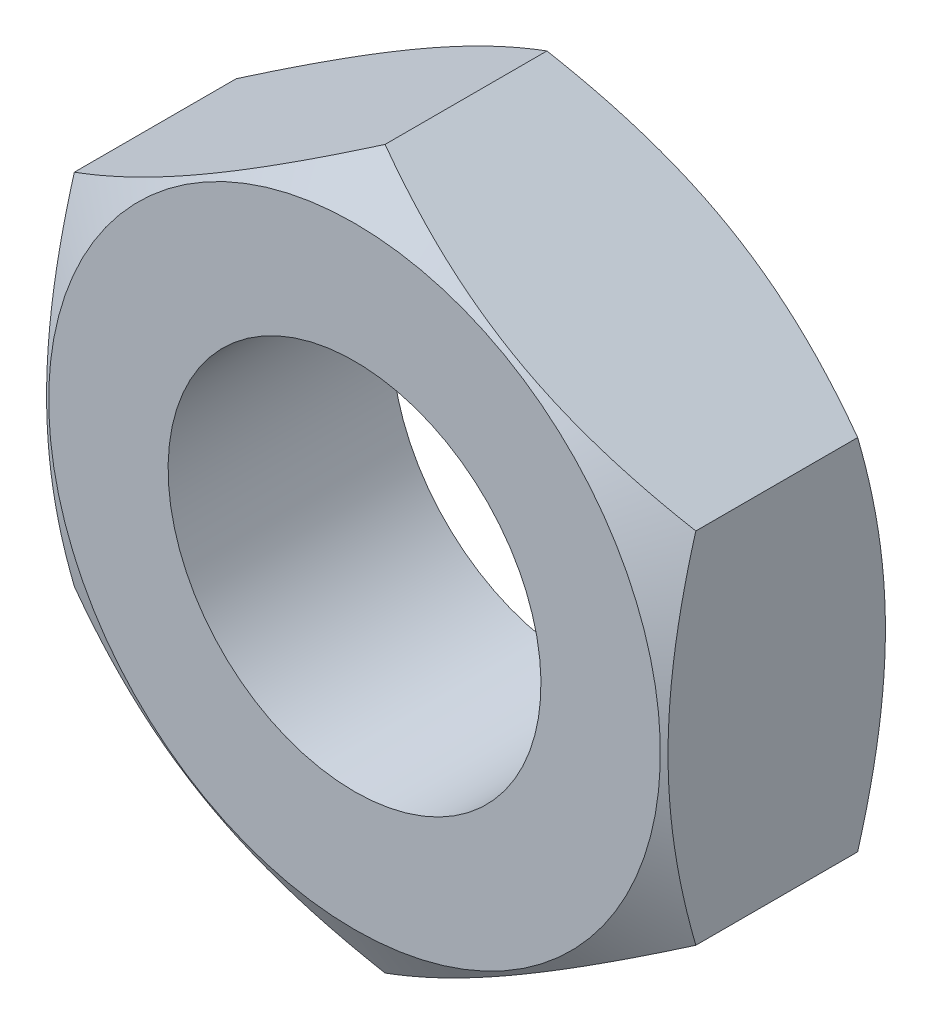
ISO-10303-21;
HEADER;
FILE_DESCRIPTION(('STEP AP214'),'2;1');
FILE_NAME('part.step','',(''),(''),'','','');
FILE_SCHEMA(('AUTOMOTIVE_DESIGN { 1 0 10303 214 1 1 1 1 }'));
ENDSEC;
DATA;
#1=APPLICATION_CONTEXT('core data for automotive mechanical design processes');
#2=APPLICATION_PROTOCOL_DEFINITION('international standard','automotive_design',2000,#1);
#3=PRODUCT_CONTEXT('',#1,'mechanical');
#4=PRODUCT('Part','Part','',(#3));
#5=PRODUCT_RELATED_PRODUCT_CATEGORY('part','',(#4));
#6=PRODUCT_DEFINITION_FORMATION('','',#4);
#7=PRODUCT_DEFINITION_CONTEXT('part definition',#1,'design');
#8=PRODUCT_DEFINITION('design','',#6,#7);
#9=PRODUCT_DEFINITION_SHAPE('','',#8);
#10=(LENGTH_UNIT() NAMED_UNIT(*) SI_UNIT(.MILLI.,.METRE.));
#11=(NAMED_UNIT(*) PLANE_ANGLE_UNIT() SI_UNIT($,.RADIAN.));
#12=(NAMED_UNIT(*) SI_UNIT($,.STERADIAN.) SOLID_ANGLE_UNIT());
#13=UNCERTAINTY_MEASURE_WITH_UNIT(LENGTH_MEASURE(1.E-05),#10,'distance_accuracy_value','');
#14=(GEOMETRIC_REPRESENTATION_CONTEXT(3) GLOBAL_UNCERTAINTY_ASSIGNED_CONTEXT((#13)) GLOBAL_UNIT_ASSIGNED_CONTEXT((#10,
#11,#12)) REPRESENTATION_CONTEXT('',''));
#15=CARTESIAN_POINT('',(0.,0.,0.));
#16=DIRECTION('',(0.,0.,1.));
#17=DIRECTION('',(1.,0.,0.));
#18=AXIS2_PLACEMENT_3D('',#15,#16,#17);
#19=CARTESIAN_POINT('',(-5.,-2.88675134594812,5.));
#20=DIRECTION('',(-1.,0.,0.));
#21=DIRECTION('',(0.,0.,1.));
#22=AXIS2_PLACEMENT_3D('',#19,#20,#21);
#23=PLANE('',#22);
#24=CARTESIAN_POINT('',(-5.,-7.76888973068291,1.10753700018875));
#25=CARTESIAN_POINT('',(-5.,-7.55038555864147,1.21359022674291));
#26=CARTESIAN_POINT('',(-5.,-7.33138137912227,1.31863083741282));
#27=CARTESIAN_POINT('',(-5.,-6.89210716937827,1.52611762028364));
#28=CARTESIAN_POINT('',(-5.,-6.67183694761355,1.62856338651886));
#29=CARTESIAN_POINT('',(-5.,-6.22863695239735,1.83080353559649));
#30=CARTESIAN_POINT('',(-5.,-6.00569923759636,1.93058057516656));
#31=CARTESIAN_POINT('',(-5.,-5.55805581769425,2.12607118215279));
#32=CARTESIAN_POINT('',(-5.,-5.33335019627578,2.22178494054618));
#33=CARTESIAN_POINT('',(-5.,-4.87449835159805,2.41109483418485));
#34=CARTESIAN_POINT('',(-5.,-4.64028204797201,2.50452203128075));
#35=CARTESIAN_POINT('',(-5.,-4.16911463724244,2.68434107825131));
#36=CARTESIAN_POINT('',(-5.,-3.93216322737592,2.77073214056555));
#37=CARTESIAN_POINT('',(-5.,-3.45558748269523,2.93422177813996));
#38=CARTESIAN_POINT('',(-5.,-3.21596962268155,3.01133903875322));
#39=CARTESIAN_POINT('',(-5.,-2.73329653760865,3.15381613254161));
#40=CARTESIAN_POINT('',(-5.,-2.490242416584,3.21917965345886));
#41=CARTESIAN_POINT('',(-5.,-2.00191441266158,3.3346725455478));
#42=CARTESIAN_POINT('',(-5.,-1.75666060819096,3.38488525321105));
#43=CARTESIAN_POINT('',(-5.,-1.26308736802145,3.46725011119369));
#44=CARTESIAN_POINT('',(-5.,-1.01476822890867,3.49940399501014));
#45=CARTESIAN_POINT('',(-5.,-0.519554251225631,3.54266588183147));
#46=CARTESIAN_POINT('',(-5.,-0.272683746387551,3.55404556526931));
#47=CARTESIAN_POINT('',(-5.,0.221141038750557,3.55551027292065));
#48=CARTESIAN_POINT('',(-5.,0.468095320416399,3.54559493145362));
#49=CARTESIAN_POINT('',(-5.,0.886914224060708,3.51142373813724));
#50=CARTESIAN_POINT('',(-5.,1.05922520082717,3.49232183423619));
#51=CARTESIAN_POINT('',(-5.,1.40258789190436,3.44493179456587));
#52=CARTESIAN_POINT('',(-5.,1.57363943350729,3.41664242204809));
#53=CARTESIAN_POINT('',(-5.,2.08467634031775,3.31947971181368));
#54=CARTESIAN_POINT('',(-5.,2.42235363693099,3.23832937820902));
#55=CARTESIAN_POINT('',(-5.,2.927286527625,3.09758707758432));
#56=CARTESIAN_POINT('',(-5.,3.09715891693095,3.04684829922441));
#57=CARTESIAN_POINT('',(-5.,3.43525357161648,2.94009442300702));
#58=CARTESIAN_POINT('',(-5.,3.60347582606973,2.88407929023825));
#59=CARTESIAN_POINT('',(-5.,3.93832333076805,2.76767214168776));
#60=CARTESIAN_POINT('',(-5.,4.1049490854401,2.70728156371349));
#61=CARTESIAN_POINT('',(-5.,4.43681968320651,2.58283463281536));
#62=CARTESIAN_POINT('',(-5.,4.60206454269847,2.51877832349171));
#63=CARTESIAN_POINT('',(-5.,4.99284806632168,2.36309983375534));
#64=CARTESIAN_POINT('',(-5.,5.21784519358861,2.27012076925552));
#65=CARTESIAN_POINT('',(-5.,5.66591568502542,2.07962413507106));
#66=CARTESIAN_POINT('',(-5.,5.8889889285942,1.98210628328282));
#67=CARTESIAN_POINT('',(-5.,6.33356725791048,1.78344739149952));
#68=CARTESIAN_POINT('',(-5.,6.555072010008,1.68230560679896));
#69=CARTESIAN_POINT('',(-5.,6.99673606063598,1.4771214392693));
#70=CARTESIAN_POINT('',(-5.,7.21689532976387,1.37307899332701));
#71=CARTESIAN_POINT('',(-5.,7.87616934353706,1.05722279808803));
#72=CARTESIAN_POINT('',(-5.,8.31360066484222,0.84189756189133));
#73=CARTESIAN_POINT('',(-5.,9.18522358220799,0.40496033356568));
#74=CARTESIAN_POINT('',(-5.,9.61941556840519,0.183349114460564));
#75=CARTESIAN_POINT('',(-5.,10.4489459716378,-0.245468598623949));
#76=CARTESIAN_POINT('',(-5.,10.8444719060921,-0.452313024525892));
#77=CARTESIAN_POINT('',(-5.,11.634051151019,-0.868823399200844));
#78=CARTESIAN_POINT('',(-5.,12.0281044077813,-1.07848944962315));
#79=CARTESIAN_POINT('',(-5.,12.8140667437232,-1.49943898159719));
#80=CARTESIAN_POINT('',(-5.,13.205978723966,-1.71071705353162));
#81=CARTESIAN_POINT('',(-5.,13.9888614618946,-2.13495852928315));
#82=CARTESIAN_POINT('',(-5.,14.3798322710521,-2.34792183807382));
#83=CARTESIAN_POINT('',(-5.,14.7704570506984,-2.56151337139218));
#84=B_SPLINE_CURVE_WITH_KNOTS('',3,(#24,#25,#26,#27,#28,#29,#30,#31,#32,#33,#34,#35,#36,#37,#38,
#39,#40,#41,#42,#43,#44,#45,#46,#47,#48,#49,#50,#51,#52,#53,#54,#55,#56,#57,#58,#59,#60,#61,#62,
#63,#64,#65,#66,#67,#68,#69,#70,#71,#72,#73,#74,#75,#76,#77,#78,#79,#80,#81,#82,#83),
.UNSPECIFIED.,.F.,.F.,(4,2,2,2,2,2,2,2,2,2,2,2,2,2,2,2,2,2,2,2,2,2,2,2,2,2,2,2,2,4),(0.,
0.728652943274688,1.45741918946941,2.19012823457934,2.92280280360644,3.67920287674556,
4.43568749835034,5.19062142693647,5.94531807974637,6.6957845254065,7.44617892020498,
8.18668752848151,8.92720885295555,9.44705650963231,9.966974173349,11.0073803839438,
11.539199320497,12.0710217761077,12.6026702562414,13.1343124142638,13.8646007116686,
14.5949344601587,15.3254191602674,16.0559197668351,17.5185003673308,18.9809018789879,
20.3199269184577,21.6590003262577,22.9946981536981,24.3303211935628),.UNSPECIFIED.);
#85=CARTESIAN_POINT('',(-5.,2.88675134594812,3.10823427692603));
#86=VERTEX_POINT('',#85);
#87=CARTESIAN_POINT('',(-5.,-2.88675134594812,3.10823427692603));
#88=VERTEX_POINT('',#87);
#89=EDGE_CURVE('E74',#86,#88,#84,.F.);
#90=ORIENTED_EDGE('',*,*,#89,.F.);
#91=DIRECTION('',(0.,0.,-1.));
#92=VECTOR('',#91,1.);
#93=CARTESIAN_POINT('',(-5.,2.88675134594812,5.));
#94=LINE('',#93,#92);
#95=CARTESIAN_POINT('',(-5.,2.88675134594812,0.504317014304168));
#96=VERTEX_POINT('',#95);
#97=EDGE_CURVE('E43',#86,#96,#94,.T.);
#98=ORIENTED_EDGE('',*,*,#97,.T.);
#99=CARTESIAN_POINT('',(-5.,-7.78275116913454,2.5117456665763));
#100=CARTESIAN_POINT('',(-5.,-7.56412896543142,2.40557968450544));
#101=CARTESIAN_POINT('',(-5.,-7.34500796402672,2.30042341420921));
#102=CARTESIAN_POINT('',(-5.,-6.90550322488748,2.09269759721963));
#103=CARTESIAN_POINT('',(-5.,-6.68511929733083,1.99012845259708));
#104=CARTESIAN_POINT('',(-5.,-6.24170172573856,1.78763426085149));
#105=CARTESIAN_POINT('',(-5.,-6.01866020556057,1.68772640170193));
#106=CARTESIAN_POINT('',(-5.,-5.57081317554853,1.49196112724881));
#107=CARTESIAN_POINT('',(-5.,-5.34600774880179,1.39610352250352));
#108=CARTESIAN_POINT('',(-5.,-4.88690528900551,1.20646272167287));
#109=CARTESIAN_POINT('',(-5.,-4.65253781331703,1.11284913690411));
#110=CARTESIAN_POINT('',(-5.,-4.18107142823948,0.932638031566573));
#111=CARTESIAN_POINT('',(-5.,-3.94397221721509,0.846041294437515));
#112=CARTESIAN_POINT('',(-5.,-3.46709984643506,0.6821162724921));
#113=CARTESIAN_POINT('',(-5.,-3.22733311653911,0.604769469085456));
#114=CARTESIAN_POINT('',(-5.,-2.74436018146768,0.461807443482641));
#115=CARTESIAN_POINT('',(-5.,-2.50115507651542,0.3961885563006));
#116=CARTESIAN_POINT('',(-5.,-2.01252592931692,0.280164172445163));
#117=CARTESIAN_POINT('',(-5.,-1.7671221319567,0.229674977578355));
#118=CARTESIAN_POINT('',(-5.,-1.27323263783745,0.146742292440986));
#119=CARTESIAN_POINT('',(-5.,-1.02474724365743,0.11429704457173));
#120=CARTESIAN_POINT('',(-5.,-0.5291932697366,0.0704641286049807));
#121=CARTESIAN_POINT('',(-5.,-0.282149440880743,0.0588035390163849));
#122=CARTESIAN_POINT('',(-5.,0.212045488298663,0.0568083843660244));
#123=CARTESIAN_POINT('',(-5.,0.459196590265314,0.0664741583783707));
#124=CARTESIAN_POINT('',(-5.,0.877939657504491,0.100231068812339));
#125=CARTESIAN_POINT('',(-5.,1.04997621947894,0.119130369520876));
#126=CARTESIAN_POINT('',(-5.,1.39280116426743,0.166101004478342));
#127=CARTESIAN_POINT('',(-5.,1.56358937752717,0.194173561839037));
#128=CARTESIAN_POINT('',(-5.,2.0738480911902,0.290676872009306));
#129=CARTESIAN_POINT('',(-5.,2.41102478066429,0.371376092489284));
#130=CARTESIAN_POINT('',(-5.,2.91523126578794,0.511452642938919));
#131=CARTESIAN_POINT('',(-5.,3.08487099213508,0.561971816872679));
#132=CARTESIAN_POINT('',(-5.,3.4225028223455,0.668292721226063));
#133=CARTESIAN_POINT('',(-5.,3.59049491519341,0.724094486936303));
#134=CARTESIAN_POINT('',(-5.,3.92488399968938,0.840082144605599));
#135=CARTESIAN_POINT('',(-5.,4.09128148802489,0.900266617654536));
#136=CARTESIAN_POINT('',(-5.,4.42269544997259,1.0243081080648));
#137=CARTESIAN_POINT('',(-5.,4.5877119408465,1.08816507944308));
#138=CARTESIAN_POINT('',(-5.,4.98133671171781,1.24472338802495));
#139=CARTESIAN_POINT('',(-5.,5.20936850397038,1.33887160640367));
#140=CARTESIAN_POINT('',(-5.,5.66345412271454,1.53183680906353));
#141=CARTESIAN_POINT('',(-5.,5.88950781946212,1.63065409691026));
#142=CARTESIAN_POINT('',(-5.,6.3400079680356,1.83200505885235));
#143=CARTESIAN_POINT('',(-5.,6.5644540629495,1.9345395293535));
#144=CARTESIAN_POINT('',(-5.,7.01196935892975,2.14257503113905));
#145=CARTESIAN_POINT('',(-5.,7.2350385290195,2.24807612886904));
#146=CARTESIAN_POINT('',(-5.,7.9030280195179,2.56838851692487));
#147=CARTESIAN_POINT('',(-5.,8.34622952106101,2.78678181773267));
#148=CARTESIAN_POINT('',(-5.,9.22933631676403,3.22995198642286));
#149=CARTESIAN_POINT('',(-5.,9.66924202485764,3.45472803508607));
#150=CARTESIAN_POINT('',(-5.,10.5090819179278,3.8893476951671));
#151=CARTESIAN_POINT('',(-5.,10.9092091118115,4.09881904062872));
#152=CARTESIAN_POINT('',(-5.,11.7079794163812,4.52060394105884));
#153=CARTESIAN_POINT('',(-5.,12.106622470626,4.73291760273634));
#154=CARTESIAN_POINT('',(-5.,12.9017202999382,5.15915381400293));
#155=CARTESIAN_POINT('',(-5.,13.2981780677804,5.37307078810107));
#156=CARTESIAN_POINT('',(-5.,14.0901470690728,5.80259644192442));
#157=CARTESIAN_POINT('',(-5.,14.4856583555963,6.01820502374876));
#158=CARTESIAN_POINT('',(-5.,14.8808227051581,6.2344429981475));
#159=B_SPLINE_CURVE_WITH_KNOTS('',3,(#99,#100,#101,#102,#103,#104,#105,#106,#107,#108,#109,#110,
#111,#112,#113,#114,#115,#116,#117,#118,#119,#120,#121,#122,#123,#124,#125,#126,#127,#128,#129,
#130,#131,#132,#133,#134,#135,#136,#137,#138,#139,#140,#141,#142,#143,#144,#145,#146,#147,#148,
#149,#150,#151,#152,#153,#154,#155,#156,#157,#158),.UNSPECIFIED.,.F.,.F.,(4,2,2,2,2,2,2,2,2,2,2,
2,2,2,2,2,2,2,2,2,2,2,2,2,2,2,2,2,2,4),(0.,0.7291191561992,1.45835093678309,2.19150480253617,
2.92462433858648,3.6816534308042,4.43876693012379,5.19433835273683,5.94967324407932,
6.70074898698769,7.45175155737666,8.19281804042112,8.9338963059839,9.45285971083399,
9.971892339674,11.0105210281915,11.5414824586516,12.0724474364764,12.6032412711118,
13.1340284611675,13.8740667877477,14.6141532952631,15.3543993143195,16.0946619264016,
17.5768363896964,19.0588214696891,20.4137307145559,21.7686909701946,23.1201497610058,
24.4715309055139),.UNSPECIFIED.);
#160=CARTESIAN_POINT('',(-5.,-2.88675134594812,0.504317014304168));
#161=VERTEX_POINT('',#160);
#162=EDGE_CURVE('E92',#161,#96,#159,.T.);
#163=ORIENTED_EDGE('',*,*,#162,.F.);
#164=DIRECTION('',(0.,0.,-1.));
#165=VECTOR('',#164,1.);
#166=CARTESIAN_POINT('',(-5.,-2.88675134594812,5.));
#167=LINE('',#166,#165);
#168=EDGE_CURVE('E29',#88,#161,#167,.T.);
#169=ORIENTED_EDGE('',*,*,#168,.F.);
#170=EDGE_LOOP('',(#90,#98,#163,#169));
#171=FACE_BOUND('',#170,.T.);
#172=ADVANCED_FACE('F14',(#171),#23,.T.);
#173=CARTESIAN_POINT('',(-5.,-2.88675134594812,5.));
#174=DIRECTION('',(0.5,0.86602540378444,0.));
#175=DIRECTION('',(-0.86602540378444,0.5,0.));
#176=AXIS2_PLACEMENT_3D('',#173,#174,#175);
#177=PLANE('',#176);
#178=DIRECTION('',(0.,0.,-1.));
#179=VECTOR('',#178,1.);
#180=CARTESIAN_POINT('',(0.,-5.77350269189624,5.));
#181=LINE('',#180,#179);
#182=CARTESIAN_POINT('',(0.,-5.77350269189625,3.10823427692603));
#183=VERTEX_POINT('',#182);
#184=CARTESIAN_POINT('',(0.,-5.77350269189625,0.504317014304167));
#185=VERTEX_POINT('',#184);
#186=EDGE_CURVE('E99',#183,#185,#181,.T.);
#187=ORIENTED_EDGE('',*,*,#186,.F.);
#188=CARTESIAN_POINT('',(0.000199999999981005,-5.77361816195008,3.10816760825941));
#189=CARTESIAN_POINT('',(-0.219534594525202,-5.64675433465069,3.1814296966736));
#190=CARTESIAN_POINT('',(-0.441148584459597,-5.51880543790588,3.24806494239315));
#191=CARTESIAN_POINT('',(-0.888213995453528,-5.26069210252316,3.36437727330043));
#192=CARTESIAN_POINT('',(-1.11367335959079,-5.13052307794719,3.41401321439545));
#193=CARTESIAN_POINT('',(-1.56183230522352,-4.8717783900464,3.49126523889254));
#194=CARTESIAN_POINT('',(-1.78446209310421,-4.74324302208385,3.51939588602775));
#195=CARTESIAN_POINT('',(-2.11918990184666,-4.54998783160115,3.54462134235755));
#196=CARTESIAN_POINT('',(-2.23084219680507,-4.48552534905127,3.55020280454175));
#197=CARTESIAN_POINT('',(-2.45424997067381,-4.3565408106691,3.55561404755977));
#198=CARTESIAN_POINT('',(-2.56600544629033,-4.29201875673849,3.55544400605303));
#199=CARTESIAN_POINT('',(-2.87218423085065,-4.11524635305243,3.5470626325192));
#200=CARTESIAN_POINT('',(-3.06650608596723,-4.00305457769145,3.53298649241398));
#201=CARTESIAN_POINT('',(-3.45386010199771,-3.77941563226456,3.4883510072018));
#202=CARTESIAN_POINT('',(-3.64689090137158,-3.66796924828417,3.45777640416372));
#203=CARTESIAN_POINT('',(-4.03502534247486,-3.44387972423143,3.38134777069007));
#204=CARTESIAN_POINT('',(-4.23007999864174,-3.33126486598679,3.33516988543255));
#205=CARTESIAN_POINT('',(-4.61728034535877,-3.1077146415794,3.2303644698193));
#206=CARTESIAN_POINT('',(-4.80943099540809,-2.99677641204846,3.17176156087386));
#207=CARTESIAN_POINT('',(-5.0002,-2.88663587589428,3.1081676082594));
#208=B_SPLINE_CURVE_WITH_KNOTS('',3,(#188,#189,#190,#191,#192,#193,#194,#195,#196,#197,#198,
#199,#200,#201,#202,#203,#204,#205,#206,#207),.UNSPECIFIED.,.F.,.F.,(4,2,2,2,2,2,2,2,2,4),(0.,
0.792555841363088,1.58701660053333,2.3618153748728,2.74884076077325,3.13585419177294,
3.80962362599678,4.48401723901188,5.17336882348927,5.86136694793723),.UNSPECIFIED.);
#209=EDGE_CURVE('E80',#183,#88,#208,.T.);
#210=ORIENTED_EDGE('',*,*,#209,.T.);
#211=ORIENTED_EDGE('',*,*,#168,.T.);
#212=CARTESIAN_POINT('',(-5.0002,-2.88663587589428,0.504383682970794));
#213=CARTESIAN_POINT('',(-4.78046540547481,-3.01349970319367,0.431121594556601));
#214=CARTESIAN_POINT('',(-4.55885141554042,-3.14144859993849,0.364486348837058));
#215=CARTESIAN_POINT('',(-4.11178600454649,-3.3995619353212,0.248174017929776));
#216=CARTESIAN_POINT('',(-3.88632664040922,-3.52973095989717,0.198538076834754));
#217=CARTESIAN_POINT('',(-3.43816769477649,-3.78847564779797,0.121286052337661));
#218=CARTESIAN_POINT('',(-3.2155379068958,-3.91701101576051,0.0931554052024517));
#219=CARTESIAN_POINT('',(-2.88081009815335,-4.11026620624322,0.0679299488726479));
#220=CARTESIAN_POINT('',(-2.76915780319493,-4.1747286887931,0.0623484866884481));
#221=CARTESIAN_POINT('',(-2.5457500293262,-4.30371322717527,0.0569372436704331));
#222=CARTESIAN_POINT('',(-2.43399455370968,-4.36823528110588,0.0571072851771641));
#223=CARTESIAN_POINT('',(-2.12781576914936,-4.54500768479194,0.0654886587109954));
#224=CARTESIAN_POINT('',(-1.93349391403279,-4.65719946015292,0.0795647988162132));
#225=CARTESIAN_POINT('',(-1.5461398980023,-4.8808384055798,0.124200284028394));
#226=CARTESIAN_POINT('',(-1.35310909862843,-4.99228478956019,0.154774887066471));
#227=CARTESIAN_POINT('',(-0.964974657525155,-5.21637431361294,0.231203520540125));
#228=CARTESIAN_POINT('',(-0.769920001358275,-5.32898917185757,0.277381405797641));
#229=CARTESIAN_POINT('',(-0.382719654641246,-5.55253939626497,0.382186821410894));
#230=CARTESIAN_POINT('',(-0.19056900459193,-5.6634776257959,0.440789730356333));
#231=CARTESIAN_POINT('',(0.000199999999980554,-5.77361816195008,0.504383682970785));
#232=B_SPLINE_CURVE_WITH_KNOTS('',3,(#212,#213,#214,#215,#216,#217,#218,#219,#220,#221,#222,
#223,#224,#225,#226,#227,#228,#229,#230,#231),.UNSPECIFIED.,.F.,.F.,(4,2,2,2,2,2,2,2,2,4),(0.,
0.792555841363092,1.58701660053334,2.36181537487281,2.74884076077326,3.13585419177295,
3.80962362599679,4.48401723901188,5.17336882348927,5.86136694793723),.UNSPECIFIED.);
#233=EDGE_CURVE('E164',#161,#185,#232,.T.);
#234=ORIENTED_EDGE('',*,*,#233,.T.);
#235=EDGE_LOOP('',(#187,#210,#211,#234));
#236=FACE_BOUND('',#235,.T.);
#237=ADVANCED_FACE('F16',(#236),#177,.F.);
#238=CARTESIAN_POINT('',(5.,-2.88675134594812,5.));
#239=DIRECTION('',(0.5,-0.86602540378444,0.));
#240=DIRECTION('',(0.86602540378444,0.5,0.));
#241=AXIS2_PLACEMENT_3D('',#238,#239,#240);
#242=PLANE('',#241);
#243=CARTESIAN_POINT('',(-0.000200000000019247,-5.7736181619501,3.1081676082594));
#244=CARTESIAN_POINT('',(0.219534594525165,-5.64675433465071,3.18142969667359));
#245=CARTESIAN_POINT('',(0.441148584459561,-5.5188054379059,3.24806494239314));
#246=CARTESIAN_POINT('',(0.888213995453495,-5.26069210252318,3.36437727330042));
#247=CARTESIAN_POINT('',(1.11367335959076,-5.13052307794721,3.41401321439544));
#248=CARTESIAN_POINT('',(1.56183230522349,-4.87177839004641,3.49126523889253));
#249=CARTESIAN_POINT('',(1.78446209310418,-4.74324302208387,3.51939588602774));
#250=CARTESIAN_POINT('',(2.11918990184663,-4.54998783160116,3.54462134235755));
#251=CARTESIAN_POINT('',(2.23084219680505,-4.48552534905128,3.55020280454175));
#252=CARTESIAN_POINT('',(2.45424997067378,-4.35654081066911,3.55561404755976));
#253=CARTESIAN_POINT('',(2.5660054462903,-4.2920187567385,3.55544400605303));
#254=CARTESIAN_POINT('',(2.87218423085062,-4.11524635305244,3.5470626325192));
#255=CARTESIAN_POINT('',(3.0665060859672,-4.00305457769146,3.53298649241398));
#256=CARTESIAN_POINT('',(3.4538601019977,-3.77941563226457,3.4883510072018));
#257=CARTESIAN_POINT('',(3.64689090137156,-3.66796924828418,3.45777640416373));
#258=CARTESIAN_POINT('',(4.03502534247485,-3.44387972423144,3.38134777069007));
#259=CARTESIAN_POINT('',(4.23007999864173,-3.3312648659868,3.33516988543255));
#260=CARTESIAN_POINT('',(4.61728034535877,-3.1077146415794,3.2303644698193));
#261=CARTESIAN_POINT('',(4.80943099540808,-2.99677641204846,3.17176156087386));
#262=CARTESIAN_POINT('',(5.0002,-2.88663587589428,3.1081676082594));
#263=B_SPLINE_CURVE_WITH_KNOTS('',3,(#243,#244,#245,#246,#247,#248,#249,#250,#251,#252,#253,
#254,#255,#256,#257,#258,#259,#260,#261,#262),.UNSPECIFIED.,.F.,.F.,(4,2,2,2,2,2,2,2,2,4),(0.,
0.792555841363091,1.58701660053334,2.36181537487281,2.74884076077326,3.13585419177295,
3.8096236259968,4.48401723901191,5.1733688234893,5.86136694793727),.UNSPECIFIED.);
#264=CARTESIAN_POINT('',(5.,-2.88675134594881,3.10823427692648));
#265=VERTEX_POINT('',#264);
#266=EDGE_CURVE('E135',#183,#265,#263,.T.);
#267=ORIENTED_EDGE('',*,*,#266,.F.);
#268=ORIENTED_EDGE('',*,*,#186,.T.);
#269=CARTESIAN_POINT('',(5.0002,-2.88663587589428,0.504383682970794));
#270=CARTESIAN_POINT('',(4.78046540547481,-3.01349970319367,0.431121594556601));
#271=CARTESIAN_POINT('',(4.55885141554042,-3.14144859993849,0.364486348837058));
#272=CARTESIAN_POINT('',(4.11178600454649,-3.3995619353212,0.248174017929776));
#273=CARTESIAN_POINT('',(3.88632664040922,-3.52973095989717,0.198538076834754));
#274=CARTESIAN_POINT('',(3.43816769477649,-3.78847564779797,0.121286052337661));
#275=CARTESIAN_POINT('',(3.2155379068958,-3.91701101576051,0.0931554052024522));
#276=CARTESIAN_POINT('',(2.88081009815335,-4.11026620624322,0.067929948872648));
#277=CARTESIAN_POINT('',(2.76915780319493,-4.1747286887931,0.062348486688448));
#278=CARTESIAN_POINT('',(2.5457500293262,-4.30371322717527,0.0569372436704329));
#279=CARTESIAN_POINT('',(2.43399455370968,-4.36823528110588,0.057107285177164));
#280=CARTESIAN_POINT('',(2.12781576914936,-4.54500768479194,0.0654886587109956));
#281=CARTESIAN_POINT('',(1.93349391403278,-4.65719946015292,0.079564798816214));
#282=CARTESIAN_POINT('',(1.54613989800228,-4.88083840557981,0.124200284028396));
#283=CARTESIAN_POINT('',(1.35310909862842,-4.9922847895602,0.154774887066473));
#284=CARTESIAN_POINT('',(0.964974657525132,-5.21637431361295,0.23120352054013));
#285=CARTESIAN_POINT('',(0.76992000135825,-5.32898917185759,0.277381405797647));
#286=CARTESIAN_POINT('',(0.382719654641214,-5.55253939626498,0.382186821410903));
#287=CARTESIAN_POINT('',(0.190569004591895,-5.66347762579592,0.440789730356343));
#288=CARTESIAN_POINT('',(-0.000200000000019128,-5.7736181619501,0.504383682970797));
#289=B_SPLINE_CURVE_WITH_KNOTS('',3,(#269,#270,#271,#272,#273,#274,#275,#276,#277,#278,#279,
#280,#281,#282,#283,#284,#285,#286,#287,#288),.UNSPECIFIED.,.F.,.F.,(4,2,2,2,2,2,2,2,2,4),(0.,
0.792555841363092,1.58701660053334,2.36181537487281,2.74884076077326,3.13585419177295,
3.8096236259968,4.48401723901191,5.17336882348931,5.86136694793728),.UNSPECIFIED.);
#290=CARTESIAN_POINT('',(5.,-2.88675134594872,0.50431701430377));
#291=VERTEX_POINT('',#290);
#292=EDGE_CURVE('E196',#291,#185,#289,.T.);
#293=ORIENTED_EDGE('',*,*,#292,.F.);
#294=DIRECTION('',(0.,0.,-1.));
#295=VECTOR('',#294,1.);
#296=CARTESIAN_POINT('',(5.,-2.88675134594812,5.));
#297=LINE('',#296,#295);
#298=EDGE_CURVE('E97',#265,#291,#297,.T.);
#299=ORIENTED_EDGE('',*,*,#298,.F.);
#300=EDGE_LOOP('',(#267,#268,#293,#299));
#301=FACE_BOUND('',#300,.T.);
#302=ADVANCED_FACE('F202',(#301),#242,.T.);
#303=CARTESIAN_POINT('',(5.,-2.88675134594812,5.));
#304=DIRECTION('',(-1.,0.,0.));
#305=DIRECTION('',(0.,0.,1.));
#306=AXIS2_PLACEMENT_3D('',#303,#304,#305);
#307=PLANE('',#306);
#308=DIRECTION('',(0.,0.,-1.));
#309=VECTOR('',#308,1.);
#310=CARTESIAN_POINT('',(5.,2.88675134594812,5.));
#311=LINE('',#310,#309);
#312=CARTESIAN_POINT('',(5.,2.88675134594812,3.10823427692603));
#313=VERTEX_POINT('',#312);
#314=CARTESIAN_POINT('',(5.,2.88675134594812,0.504317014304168));
#315=VERTEX_POINT('',#314);
#316=EDGE_CURVE('E89',#313,#315,#311,.T.);
#317=ORIENTED_EDGE('',*,*,#316,.F.);
#318=CARTESIAN_POINT('',(5.,-7.76888973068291,1.10753700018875));
#319=CARTESIAN_POINT('',(5.,-7.55038555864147,1.21359022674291));
#320=CARTESIAN_POINT('',(5.,-7.33138137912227,1.31863083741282));
#321=CARTESIAN_POINT('',(5.,-6.89210716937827,1.52611762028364));
#322=CARTESIAN_POINT('',(5.,-6.67183694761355,1.62856338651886));
#323=CARTESIAN_POINT('',(5.,-6.22863695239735,1.83080353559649));
#324=CARTESIAN_POINT('',(5.,-6.00569923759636,1.93058057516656));
#325=CARTESIAN_POINT('',(5.,-5.55805581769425,2.12607118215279));
#326=CARTESIAN_POINT('',(5.,-5.33335019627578,2.22178494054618));
#327=CARTESIAN_POINT('',(5.,-4.87449835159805,2.41109483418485));
#328=CARTESIAN_POINT('',(5.,-4.64028204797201,2.50452203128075));
#329=CARTESIAN_POINT('',(5.,-4.16911463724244,2.68434107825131));
#330=CARTESIAN_POINT('',(5.,-3.93216322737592,2.77073214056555));
#331=CARTESIAN_POINT('',(5.,-3.45558748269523,2.93422177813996));
#332=CARTESIAN_POINT('',(5.,-3.21596962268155,3.01133903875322));
#333=CARTESIAN_POINT('',(5.,-2.73329653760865,3.15381613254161));
#334=CARTESIAN_POINT('',(5.,-2.490242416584,3.21917965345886));
#335=CARTESIAN_POINT('',(5.,-2.00191441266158,3.3346725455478));
#336=CARTESIAN_POINT('',(5.,-1.75666060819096,3.38488525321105));
#337=CARTESIAN_POINT('',(5.,-1.26308736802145,3.46725011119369));
#338=CARTESIAN_POINT('',(5.,-1.01476822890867,3.49940399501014));
#339=CARTESIAN_POINT('',(5.,-0.519554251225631,3.54266588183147));
#340=CARTESIAN_POINT('',(5.,-0.272683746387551,3.55404556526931));
#341=CARTESIAN_POINT('',(5.,0.221141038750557,3.55551027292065));
#342=CARTESIAN_POINT('',(5.,0.468095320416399,3.54559493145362));
#343=CARTESIAN_POINT('',(5.,0.886914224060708,3.51142373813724));
#344=CARTESIAN_POINT('',(5.,1.05922520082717,3.49232183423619));
#345=CARTESIAN_POINT('',(5.,1.40258789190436,3.44493179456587));
#346=CARTESIAN_POINT('',(5.,1.57363943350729,3.41664242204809));
#347=CARTESIAN_POINT('',(5.,2.08467634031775,3.31947971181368));
#348=CARTESIAN_POINT('',(5.,2.42235363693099,3.23832937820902));
#349=CARTESIAN_POINT('',(5.,2.927286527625,3.09758707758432));
#350=CARTESIAN_POINT('',(5.,3.09715891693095,3.04684829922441));
#351=CARTESIAN_POINT('',(5.,3.43525357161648,2.94009442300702));
#352=CARTESIAN_POINT('',(5.,3.60347582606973,2.88407929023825));
#353=CARTESIAN_POINT('',(5.,3.93832333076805,2.76767214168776));
#354=CARTESIAN_POINT('',(5.,4.1049490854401,2.70728156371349));
#355=CARTESIAN_POINT('',(5.,4.43681968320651,2.58283463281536));
#356=CARTESIAN_POINT('',(5.,4.60206454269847,2.51877832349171));
#357=CARTESIAN_POINT('',(5.,4.99284806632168,2.36309983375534));
#358=CARTESIAN_POINT('',(5.,5.21784519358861,2.27012076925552));
#359=CARTESIAN_POINT('',(5.,5.66591568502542,2.07962413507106));
#360=CARTESIAN_POINT('',(5.,5.8889889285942,1.98210628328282));
#361=CARTESIAN_POINT('',(5.,6.33356725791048,1.78344739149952));
#362=CARTESIAN_POINT('',(5.,6.555072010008,1.68230560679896));
#363=CARTESIAN_POINT('',(5.,6.99673606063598,1.4771214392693));
#364=CARTESIAN_POINT('',(5.,7.21689532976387,1.37307899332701));
#365=CARTESIAN_POINT('',(5.,7.87616934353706,1.05722279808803));
#366=CARTESIAN_POINT('',(5.,8.31360066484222,0.84189756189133));
#367=CARTESIAN_POINT('',(5.,9.18522358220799,0.40496033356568));
#368=CARTESIAN_POINT('',(5.,9.61941556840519,0.183349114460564));
#369=CARTESIAN_POINT('',(5.,10.4489459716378,-0.245468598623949));
#370=CARTESIAN_POINT('',(5.,10.8444719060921,-0.452313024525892));
#371=CARTESIAN_POINT('',(5.,11.634051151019,-0.868823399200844));
#372=CARTESIAN_POINT('',(5.,12.0281044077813,-1.07848944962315));
#373=CARTESIAN_POINT('',(5.,12.8140667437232,-1.49943898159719));
#374=CARTESIAN_POINT('',(5.,13.205978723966,-1.71071705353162));
#375=CARTESIAN_POINT('',(5.,13.9888614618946,-2.13495852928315));
#376=CARTESIAN_POINT('',(5.,14.3798322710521,-2.34792183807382));
#377=CARTESIAN_POINT('',(5.,14.7704570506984,-2.56151337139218));
#378=B_SPLINE_CURVE_WITH_KNOTS('',3,(#318,#319,#320,#321,#322,#323,#324,#325,#326,#327,#328,
#329,#330,#331,#332,#333,#334,#335,#336,#337,#338,#339,#340,#341,#342,#343,#344,#345,#346,#347,
#348,#349,#350,#351,#352,#353,#354,#355,#356,#357,#358,#359,#360,#361,#362,#363,#364,#365,#366,
#367,#368,#369,#370,#371,#372,#373,#374,#375,#376,#377),.UNSPECIFIED.,.F.,.F.,(4,2,2,2,2,2,2,2,
2,2,2,2,2,2,2,2,2,2,2,2,2,2,2,2,2,2,2,2,2,4),(0.,0.728652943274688,1.45741918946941,
2.19012823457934,2.92280280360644,3.67920287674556,4.43568749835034,5.19062142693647,
5.94531807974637,6.6957845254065,7.44617892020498,8.18668752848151,8.92720885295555,
9.44705650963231,9.966974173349,11.0073803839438,11.539199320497,12.0710217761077,
12.6026702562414,13.1343124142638,13.8646007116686,14.5949344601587,15.3254191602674,
16.0559197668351,17.5185003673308,18.9809018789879,20.3199269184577,21.6590003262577,
22.9946981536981,24.3303211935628),.UNSPECIFIED.);
#379=EDGE_CURVE('E106',#313,#265,#378,.F.);
#380=ORIENTED_EDGE('',*,*,#379,.T.);
#381=ORIENTED_EDGE('',*,*,#298,.T.);
#382=CARTESIAN_POINT('',(5.,-7.78275116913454,2.5117456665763));
#383=CARTESIAN_POINT('',(5.,-7.56412896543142,2.40557968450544));
#384=CARTESIAN_POINT('',(5.,-7.34500796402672,2.30042341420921));
#385=CARTESIAN_POINT('',(5.,-6.90550322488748,2.09269759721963));
#386=CARTESIAN_POINT('',(5.,-6.68511929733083,1.99012845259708));
#387=CARTESIAN_POINT('',(5.,-6.24170172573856,1.78763426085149));
#388=CARTESIAN_POINT('',(5.,-6.01866020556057,1.68772640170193));
#389=CARTESIAN_POINT('',(5.,-5.57081317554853,1.49196112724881));
#390=CARTESIAN_POINT('',(5.,-5.34600774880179,1.39610352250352));
#391=CARTESIAN_POINT('',(5.,-4.88690528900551,1.20646272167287));
#392=CARTESIAN_POINT('',(5.,-4.65253781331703,1.11284913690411));
#393=CARTESIAN_POINT('',(5.,-4.18107142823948,0.932638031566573));
#394=CARTESIAN_POINT('',(5.,-3.94397221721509,0.846041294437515));
#395=CARTESIAN_POINT('',(5.,-3.46709984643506,0.6821162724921));
#396=CARTESIAN_POINT('',(5.,-3.22733311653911,0.604769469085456));
#397=CARTESIAN_POINT('',(5.,-2.74436018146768,0.461807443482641));
#398=CARTESIAN_POINT('',(5.,-2.50115507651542,0.3961885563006));
#399=CARTESIAN_POINT('',(5.,-2.01252592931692,0.280164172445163));
#400=CARTESIAN_POINT('',(5.,-1.7671221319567,0.229674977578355));
#401=CARTESIAN_POINT('',(5.,-1.27323263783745,0.146742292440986));
#402=CARTESIAN_POINT('',(5.,-1.02474724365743,0.11429704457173));
#403=CARTESIAN_POINT('',(5.,-0.5291932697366,0.0704641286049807));
#404=CARTESIAN_POINT('',(5.,-0.282149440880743,0.0588035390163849));
#405=CARTESIAN_POINT('',(5.,0.212045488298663,0.0568083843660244));
#406=CARTESIAN_POINT('',(5.,0.459196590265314,0.0664741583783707));
#407=CARTESIAN_POINT('',(5.,0.877939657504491,0.100231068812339));
#408=CARTESIAN_POINT('',(5.,1.04997621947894,0.119130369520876));
#409=CARTESIAN_POINT('',(5.,1.39280116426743,0.166101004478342));
#410=CARTESIAN_POINT('',(5.,1.56358937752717,0.194173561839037));
#411=CARTESIAN_POINT('',(5.,2.0738480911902,0.290676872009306));
#412=CARTESIAN_POINT('',(5.,2.41102478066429,0.371376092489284));
#413=CARTESIAN_POINT('',(5.,2.91523126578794,0.511452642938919));
#414=CARTESIAN_POINT('',(5.,3.08487099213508,0.561971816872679));
#415=CARTESIAN_POINT('',(5.,3.4225028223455,0.668292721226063));
#416=CARTESIAN_POINT('',(5.,3.59049491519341,0.724094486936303));
#417=CARTESIAN_POINT('',(5.,3.92488399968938,0.840082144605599));
#418=CARTESIAN_POINT('',(5.,4.09128148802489,0.900266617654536));
#419=CARTESIAN_POINT('',(5.,4.42269544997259,1.0243081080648));
#420=CARTESIAN_POINT('',(5.,4.5877119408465,1.08816507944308));
#421=CARTESIAN_POINT('',(5.,4.98133671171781,1.24472338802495));
#422=CARTESIAN_POINT('',(5.,5.20936850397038,1.33887160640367));
#423=CARTESIAN_POINT('',(5.,5.66345412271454,1.53183680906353));
#424=CARTESIAN_POINT('',(5.,5.88950781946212,1.63065409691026));
#425=CARTESIAN_POINT('',(5.,6.3400079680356,1.83200505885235));
#426=CARTESIAN_POINT('',(5.,6.5644540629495,1.9345395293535));
#427=CARTESIAN_POINT('',(5.,7.01196935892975,2.14257503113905));
#428=CARTESIAN_POINT('',(5.,7.2350385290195,2.24807612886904));
#429=CARTESIAN_POINT('',(5.,7.9030280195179,2.56838851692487));
#430=CARTESIAN_POINT('',(5.,8.34622952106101,2.78678181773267));
#431=CARTESIAN_POINT('',(5.,9.22933631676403,3.22995198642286));
#432=CARTESIAN_POINT('',(5.,9.66924202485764,3.45472803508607));
#433=CARTESIAN_POINT('',(5.,10.5090819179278,3.8893476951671));
#434=CARTESIAN_POINT('',(5.,10.9092091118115,4.09881904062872));
#435=CARTESIAN_POINT('',(5.,11.7079794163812,4.52060394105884));
#436=CARTESIAN_POINT('',(5.,12.106622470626,4.73291760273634));
#437=CARTESIAN_POINT('',(5.,12.9017202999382,5.15915381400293));
#438=CARTESIAN_POINT('',(5.,13.2981780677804,5.37307078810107));
#439=CARTESIAN_POINT('',(5.,14.0901470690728,5.80259644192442));
#440=CARTESIAN_POINT('',(5.,14.4856583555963,6.01820502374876));
#441=CARTESIAN_POINT('',(5.,14.8808227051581,6.2344429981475));
#442=B_SPLINE_CURVE_WITH_KNOTS('',3,(#382,#383,#384,#385,#386,#387,#388,#389,#390,#391,#392,
#393,#394,#395,#396,#397,#398,#399,#400,#401,#402,#403,#404,#405,#406,#407,#408,#409,#410,#411,
#412,#413,#414,#415,#416,#417,#418,#419,#420,#421,#422,#423,#424,#425,#426,#427,#428,#429,#430,
#431,#432,#433,#434,#435,#436,#437,#438,#439,#440,#441),.UNSPECIFIED.,.F.,.F.,(4,2,2,2,2,2,2,2,
2,2,2,2,2,2,2,2,2,2,2,2,2,2,2,2,2,2,2,2,2,4),(0.,0.7291191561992,1.45835093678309,
2.19150480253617,2.92462433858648,3.6816534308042,4.43876693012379,5.19433835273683,
5.94967324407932,6.70074898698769,7.45175155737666,8.19281804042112,8.9338963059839,
9.45285971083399,9.971892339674,11.0105210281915,11.5414824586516,12.0724474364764,
12.6032412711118,13.1340284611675,13.8740667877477,14.6141532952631,15.3543993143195,
16.0946619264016,17.5768363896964,19.0588214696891,20.4137307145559,21.7686909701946,
23.1201497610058,24.4715309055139),.UNSPECIFIED.);
#443=EDGE_CURVE('E191',#291,#315,#442,.T.);
#444=ORIENTED_EDGE('',*,*,#443,.T.);
#445=EDGE_LOOP('',(#317,#380,#381,#444));
#446=FACE_BOUND('',#445,.T.);
#447=ADVANCED_FACE('F205',(#446),#307,.F.);
#448=CARTESIAN_POINT('',(5.,2.88675134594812,5.));
#449=DIRECTION('',(-0.5,-0.86602540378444,0.));
#450=DIRECTION('',(0.86602540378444,-0.5,0.));
#451=AXIS2_PLACEMENT_3D('',#448,#449,#450);
#452=PLANE('',#451);
#453=DIRECTION('',(0.,0.,-1.));
#454=VECTOR('',#453,1.);
#455=CARTESIAN_POINT('',(0.,5.77350269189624,5.));
#456=LINE('',#455,#454);
#457=CARTESIAN_POINT('',(0.,5.77350269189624,3.10823427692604));
#458=VERTEX_POINT('',#457);
#459=CARTESIAN_POINT('',(0.,5.77350269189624,0.504317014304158));
#460=VERTEX_POINT('',#459);
#461=EDGE_CURVE('E86',#458,#460,#456,.T.);
#462=ORIENTED_EDGE('',*,*,#461,.F.);
#463=CARTESIAN_POINT('',(-0.000200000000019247,5.7736181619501,3.1081676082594));
#464=CARTESIAN_POINT('',(0.219534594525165,5.64675433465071,3.18142969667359));
#465=CARTESIAN_POINT('',(0.441148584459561,5.5188054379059,3.24806494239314));
#466=CARTESIAN_POINT('',(0.888213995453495,5.26069210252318,3.36437727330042));
#467=CARTESIAN_POINT('',(1.11367335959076,5.13052307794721,3.41401321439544));
#468=CARTESIAN_POINT('',(1.56183230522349,4.87177839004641,3.49126523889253));
#469=CARTESIAN_POINT('',(1.78446209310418,4.74324302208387,3.51939588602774));
#470=CARTESIAN_POINT('',(2.11918990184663,4.54998783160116,3.54462134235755));
#471=CARTESIAN_POINT('',(2.23084219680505,4.48552534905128,3.55020280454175));
#472=CARTESIAN_POINT('',(2.45424997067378,4.35654081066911,3.55561404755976));
#473=CARTESIAN_POINT('',(2.5660054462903,4.2920187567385,3.55544400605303));
#474=CARTESIAN_POINT('',(2.87218423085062,4.11524635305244,3.5470626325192));
#475=CARTESIAN_POINT('',(3.0665060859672,4.00305457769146,3.53298649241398));
#476=CARTESIAN_POINT('',(3.4538601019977,3.77941563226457,3.4883510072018));
#477=CARTESIAN_POINT('',(3.64689090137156,3.66796924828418,3.45777640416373));
#478=CARTESIAN_POINT('',(4.03502534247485,3.44387972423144,3.38134777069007));
#479=CARTESIAN_POINT('',(4.23007999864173,3.3312648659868,3.33516988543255));
#480=CARTESIAN_POINT('',(4.61728034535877,3.1077146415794,3.2303644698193));
#481=CARTESIAN_POINT('',(4.80943099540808,2.99677641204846,3.17176156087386));
#482=CARTESIAN_POINT('',(5.0002,2.88663587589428,3.1081676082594));
#483=B_SPLINE_CURVE_WITH_KNOTS('',3,(#463,#464,#465,#466,#467,#468,#469,#470,#471,#472,#473,
#474,#475,#476,#477,#478,#479,#480,#481,#482),.UNSPECIFIED.,.F.,.F.,(4,2,2,2,2,2,2,2,2,4),(0.,
0.792555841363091,1.58701660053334,2.36181537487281,2.74884076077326,3.13585419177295,
3.8096236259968,4.48401723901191,5.1733688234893,5.86136694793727),.UNSPECIFIED.);
#484=EDGE_CURVE('E35',#458,#313,#483,.T.);
#485=ORIENTED_EDGE('',*,*,#484,.T.);
#486=ORIENTED_EDGE('',*,*,#316,.T.);
#487=CARTESIAN_POINT('',(5.0002,2.88663587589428,0.504383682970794));
#488=CARTESIAN_POINT('',(4.78046540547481,3.01349970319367,0.431121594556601));
#489=CARTESIAN_POINT('',(4.55885141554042,3.14144859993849,0.364486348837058));
#490=CARTESIAN_POINT('',(4.11178600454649,3.3995619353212,0.248174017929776));
#491=CARTESIAN_POINT('',(3.88632664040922,3.52973095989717,0.198538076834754));
#492=CARTESIAN_POINT('',(3.43816769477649,3.78847564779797,0.121286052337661));
#493=CARTESIAN_POINT('',(3.2155379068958,3.91701101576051,0.0931554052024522));
#494=CARTESIAN_POINT('',(2.88081009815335,4.11026620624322,0.067929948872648));
#495=CARTESIAN_POINT('',(2.76915780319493,4.1747286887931,0.062348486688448));
#496=CARTESIAN_POINT('',(2.5457500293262,4.30371322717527,0.0569372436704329));
#497=CARTESIAN_POINT('',(2.43399455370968,4.36823528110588,0.057107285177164));
#498=CARTESIAN_POINT('',(2.12781576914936,4.54500768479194,0.0654886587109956));
#499=CARTESIAN_POINT('',(1.93349391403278,4.65719946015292,0.079564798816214));
#500=CARTESIAN_POINT('',(1.54613989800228,4.88083840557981,0.124200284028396));
#501=CARTESIAN_POINT('',(1.35310909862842,4.9922847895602,0.154774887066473));
#502=CARTESIAN_POINT('',(0.964974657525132,5.21637431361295,0.23120352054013));
#503=CARTESIAN_POINT('',(0.76992000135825,5.32898917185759,0.277381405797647));
#504=CARTESIAN_POINT('',(0.382719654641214,5.55253939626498,0.382186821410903));
#505=CARTESIAN_POINT('',(0.190569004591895,5.66347762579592,0.440789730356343));
#506=CARTESIAN_POINT('',(-0.000200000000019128,5.7736181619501,0.504383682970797));
#507=B_SPLINE_CURVE_WITH_KNOTS('',3,(#487,#488,#489,#490,#491,#492,#493,#494,#495,#496,#497,
#498,#499,#500,#501,#502,#503,#504,#505,#506),.UNSPECIFIED.,.F.,.F.,(4,2,2,2,2,2,2,2,2,4),(0.,
0.792555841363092,1.58701660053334,2.36181537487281,2.74884076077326,3.13585419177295,
3.8096236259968,4.48401723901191,5.17336882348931,5.86136694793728),.UNSPECIFIED.);
#508=EDGE_CURVE('E184',#315,#460,#507,.T.);
#509=ORIENTED_EDGE('',*,*,#508,.T.);
#510=EDGE_LOOP('',(#462,#485,#486,#509));
#511=FACE_BOUND('',#510,.T.);
#512=ADVANCED_FACE('F123',(#511),#452,.F.);
#513=CARTESIAN_POINT('',(-5.,2.88675134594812,5.));
#514=DIRECTION('',(-0.5,0.86602540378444,0.));
#515=DIRECTION('',(-0.86602540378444,-0.5,0.));
#516=AXIS2_PLACEMENT_3D('',#513,#514,#515);
#517=PLANE('',#516);
#518=CARTESIAN_POINT('',(0.000199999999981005,5.77361816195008,3.10816760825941));
#519=CARTESIAN_POINT('',(-0.219534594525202,5.64675433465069,3.1814296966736));
#520=CARTESIAN_POINT('',(-0.441148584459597,5.51880543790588,3.24806494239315));
#521=CARTESIAN_POINT('',(-0.888213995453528,5.26069210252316,3.36437727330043));
#522=CARTESIAN_POINT('',(-1.11367335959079,5.13052307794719,3.41401321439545));
#523=CARTESIAN_POINT('',(-1.56183230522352,4.8717783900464,3.49126523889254));
#524=CARTESIAN_POINT('',(-1.78446209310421,4.74324302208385,3.51939588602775));
#525=CARTESIAN_POINT('',(-2.11918990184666,4.54998783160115,3.54462134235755));
#526=CARTESIAN_POINT('',(-2.23084219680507,4.48552534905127,3.55020280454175));
#527=CARTESIAN_POINT('',(-2.45424997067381,4.3565408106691,3.55561404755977));
#528=CARTESIAN_POINT('',(-2.56600544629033,4.29201875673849,3.55544400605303));
#529=CARTESIAN_POINT('',(-2.87218423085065,4.11524635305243,3.5470626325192));
#530=CARTESIAN_POINT('',(-3.06650608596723,4.00305457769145,3.53298649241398));
#531=CARTESIAN_POINT('',(-3.45386010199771,3.77941563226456,3.4883510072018));
#532=CARTESIAN_POINT('',(-3.64689090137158,3.66796924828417,3.45777640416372));
#533=CARTESIAN_POINT('',(-4.03502534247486,3.44387972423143,3.38134777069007));
#534=CARTESIAN_POINT('',(-4.23007999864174,3.33126486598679,3.33516988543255));
#535=CARTESIAN_POINT('',(-4.61728034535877,3.1077146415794,3.2303644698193));
#536=CARTESIAN_POINT('',(-4.80943099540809,2.99677641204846,3.17176156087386));
#537=CARTESIAN_POINT('',(-5.0002,2.88663587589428,3.1081676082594));
#538=B_SPLINE_CURVE_WITH_KNOTS('',3,(#518,#519,#520,#521,#522,#523,#524,#525,#526,#527,#528,
#529,#530,#531,#532,#533,#534,#535,#536,#537),.UNSPECIFIED.,.F.,.F.,(4,2,2,2,2,2,2,2,2,4),(0.,
0.792555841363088,1.58701660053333,2.3618153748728,2.74884076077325,3.13585419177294,
3.80962362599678,4.48401723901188,5.17336882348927,5.86136694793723),.UNSPECIFIED.);
#539=EDGE_CURVE('E9',#458,#86,#538,.T.);
#540=ORIENTED_EDGE('',*,*,#539,.F.);
#541=ORIENTED_EDGE('',*,*,#461,.T.);
#542=CARTESIAN_POINT('',(-5.0002,2.88663587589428,0.504383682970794));
#543=CARTESIAN_POINT('',(-4.78046540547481,3.01349970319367,0.431121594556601));
#544=CARTESIAN_POINT('',(-4.55885141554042,3.14144859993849,0.364486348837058));
#545=CARTESIAN_POINT('',(-4.11178600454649,3.3995619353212,0.248174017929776));
#546=CARTESIAN_POINT('',(-3.88632664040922,3.52973095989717,0.198538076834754));
#547=CARTESIAN_POINT('',(-3.43816769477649,3.78847564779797,0.121286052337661));
#548=CARTESIAN_POINT('',(-3.2155379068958,3.91701101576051,0.0931554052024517));
#549=CARTESIAN_POINT('',(-2.88081009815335,4.11026620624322,0.0679299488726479));
#550=CARTESIAN_POINT('',(-2.76915780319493,4.1747286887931,0.0623484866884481));
#551=CARTESIAN_POINT('',(-2.5457500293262,4.30371322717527,0.0569372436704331));
#552=CARTESIAN_POINT('',(-2.43399455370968,4.36823528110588,0.0571072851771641));
#553=CARTESIAN_POINT('',(-2.12781576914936,4.54500768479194,0.0654886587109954));
#554=CARTESIAN_POINT('',(-1.93349391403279,4.65719946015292,0.0795647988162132));
#555=CARTESIAN_POINT('',(-1.5461398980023,4.8808384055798,0.124200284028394));
#556=CARTESIAN_POINT('',(-1.35310909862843,4.99228478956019,0.154774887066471));
#557=CARTESIAN_POINT('',(-0.964974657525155,5.21637431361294,0.231203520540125));
#558=CARTESIAN_POINT('',(-0.769920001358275,5.32898917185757,0.277381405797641));
#559=CARTESIAN_POINT('',(-0.382719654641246,5.55253939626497,0.382186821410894));
#560=CARTESIAN_POINT('',(-0.19056900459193,5.6634776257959,0.440789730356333));
#561=CARTESIAN_POINT('',(0.000199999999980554,5.77361816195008,0.504383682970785));
#562=B_SPLINE_CURVE_WITH_KNOTS('',3,(#542,#543,#544,#545,#546,#547,#548,#549,#550,#551,#552,
#553,#554,#555,#556,#557,#558,#559,#560,#561),.UNSPECIFIED.,.F.,.F.,(4,2,2,2,2,2,2,2,2,4),(0.,
0.792555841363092,1.58701660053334,2.36181537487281,2.74884076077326,3.13585419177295,
3.80962362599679,4.48401723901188,5.17336882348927,5.86136694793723),.UNSPECIFIED.);
#563=EDGE_CURVE('E85',#96,#460,#562,.T.);
#564=ORIENTED_EDGE('',*,*,#563,.F.);
#565=ORIENTED_EDGE('',*,*,#97,.F.);
#566=EDGE_LOOP('',(#540,#541,#564,#565));
#567=FACE_BOUND('',#566,.T.);
#568=ADVANCED_FACE('F83',(#567),#517,.T.);
#569=CARTESIAN_POINT('',(-5.,8.66025403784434,0.));
#570=DIRECTION('',(0.,0.,1.));
#571=DIRECTION('',(0.,1.,0.));
#572=AXIS2_PLACEMENT_3D('',#569,#570,#571);
#573=PLANE('',#572);
#574=CARTESIAN_POINT('',(0.,0.,0.));
#575=DIRECTION('',(0.,0.,-1.));
#576=DIRECTION('',(0.,-1.,0.));
#577=AXIS2_PLACEMENT_3D('',#574,#575,#576);
#578=CIRCLE('',#577,4.9);
#579=CARTESIAN_POINT('',(0.,-4.9,0.));
#580=VERTEX_POINT('',#579);
#581=EDGE_CURVE('E79',#580,#580,#578,.T.);
#582=ORIENTED_EDGE('',*,*,#581,.T.);
#583=EDGE_LOOP('',(#582));
#584=FACE_BOUND('',#583,.T.);
#585=CARTESIAN_POINT('',(0.,0.,0.));
#586=DIRECTION('',(0.,0.,-1.));
#587=DIRECTION('',(0.,-1.,0.));
#588=AXIS2_PLACEMENT_3D('',#585,#586,#587);
#589=CIRCLE('',#588,3.);
#590=CARTESIAN_POINT('',(0.,-3.,0.));
#591=VERTEX_POINT('',#590);
#592=EDGE_CURVE('E87',#591,#591,#589,.T.);
#593=ORIENTED_EDGE('',*,*,#592,.F.);
#594=EDGE_LOOP('',(#593));
#595=FACE_BOUND('',#594,.T.);
#596=ADVANCED_FACE('F155',(#584,#595),#573,.F.);
#597=CARTESIAN_POINT('',(0.,0.,5.));
#598=DIRECTION('',(0.,0.,-1.));
#599=DIRECTION('',(0.,-1.,0.));
#600=AXIS2_PLACEMENT_3D('',#597,#598,#599);
#601=CYLINDRICAL_SURFACE('',#600,3.);
#602=CARTESIAN_POINT('',(0.,0.,3.6));
#603=DIRECTION('',(0.,0.,-1.));
#604=DIRECTION('',(0.,-1.,0.));
#605=AXIS2_PLACEMENT_3D('',#602,#603,#604);
#606=CIRCLE('',#605,3.);
#607=CARTESIAN_POINT('',(0.,-3.,3.6));
#608=VERTEX_POINT('',#607);
#609=EDGE_CURVE('E101',#608,#608,#606,.F.);
#610=ORIENTED_EDGE('',*,*,#609,.T.);
#611=EDGE_LOOP('',(#610));
#612=FACE_BOUND('',#611,.T.);
#613=ORIENTED_EDGE('',*,*,#592,.T.);
#614=EDGE_LOOP('',(#613));
#615=FACE_BOUND('',#614,.T.);
#616=ADVANCED_FACE('F173',(#612,#615),#601,.F.);
#617=CARTESIAN_POINT('',(0.,0.,1.47005849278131));
#618=DIRECTION('',(0.,0.,1.));
#619=DIRECTION('',(0.,1.,0.));
#620=AXIS2_PLACEMENT_3D('',#617,#618,#619);
#621=CONICAL_SURFACE('',#620,7.44621599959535,1.0471975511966);
#622=ORIENTED_EDGE('',*,*,#162,.T.);
#623=ORIENTED_EDGE('',*,*,#563,.T.);
#624=ORIENTED_EDGE('',*,*,#508,.F.);
#625=ORIENTED_EDGE('',*,*,#443,.F.);
#626=ORIENTED_EDGE('',*,*,#292,.T.);
#627=ORIENTED_EDGE('',*,*,#233,.F.);
#628=EDGE_LOOP('',(#622,#623,#624,#625,#626,#627));
#629=FACE_BOUND('',#628,.T.);
#630=ORIENTED_EDGE('',*,*,#581,.F.);
#631=EDGE_LOOP('',(#630));
#632=FACE_BOUND('',#631,.T.);
#633=ADVANCED_FACE('F170',(#629,#632),#621,.T.);
#634=CARTESIAN_POINT('',(0.,0.,3.6));
#635=DIRECTION('',(0.,0.,-1.));
#636=DIRECTION('',(0.,-1.,0.));
#637=AXIS2_PLACEMENT_3D('',#634,#635,#636);
#638=PLANE('',#637);
#639=CARTESIAN_POINT('',(0.,0.,3.6));
#640=DIRECTION('',(0.,0.,-1.));
#641=DIRECTION('',(0.,-1.,0.));
#642=AXIS2_PLACEMENT_3D('',#639,#640,#641);
#643=CIRCLE('',#642,4.92173947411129);
#644=CARTESIAN_POINT('',(0.,-4.92173947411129,3.6));
#645=VERTEX_POINT('',#644);
#646=EDGE_CURVE('E103',#645,#645,#643,.T.);
#647=ORIENTED_EDGE('',*,*,#646,.F.);
#648=EDGE_LOOP('',(#647));
#649=FACE_BOUND('',#648,.T.);
#650=ORIENTED_EDGE('',*,*,#609,.F.);
#651=EDGE_LOOP('',(#650));
#652=FACE_BOUND('',#651,.T.);
#653=ADVANCED_FACE('F128',(#649,#652),#638,.F.);
#654=CARTESIAN_POINT('',(0.,0.,3.6));
#655=DIRECTION('',(0.,0.,-1.));
#656=DIRECTION('',(0.,-1.,0.));
#657=AXIS2_PLACEMENT_3D('',#654,#655,#656);
#658=CONICAL_SURFACE('',#657,4.92173947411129,1.0471975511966);
#659=ORIENTED_EDGE('',*,*,#89,.T.);
#660=ORIENTED_EDGE('',*,*,#209,.F.);
#661=ORIENTED_EDGE('',*,*,#266,.T.);
#662=ORIENTED_EDGE('',*,*,#379,.F.);
#663=ORIENTED_EDGE('',*,*,#484,.F.);
#664=ORIENTED_EDGE('',*,*,#539,.T.);
#665=EDGE_LOOP('',(#659,#660,#661,#662,#663,#664));
#666=FACE_BOUND('',#665,.T.);
#667=ORIENTED_EDGE('',*,*,#646,.T.);
#668=EDGE_LOOP('',(#667));
#669=FACE_BOUND('',#668,.T.);
#670=ADVANCED_FACE('F72',(#666,#669),#658,.T.);
#671=CLOSED_SHELL('',(#172,#237,#302,#447,#512,#568,#596,#616,#633,#653,#670));
#672=MANIFOLD_SOLID_BREP('B1',#671);
#673=ADVANCED_BREP_SHAPE_REPRESENTATION('',(#18,#672),#14);
#674=SHAPE_DEFINITION_REPRESENTATION(#9,#673);
ENDSEC;
END-ISO-10303-21;
